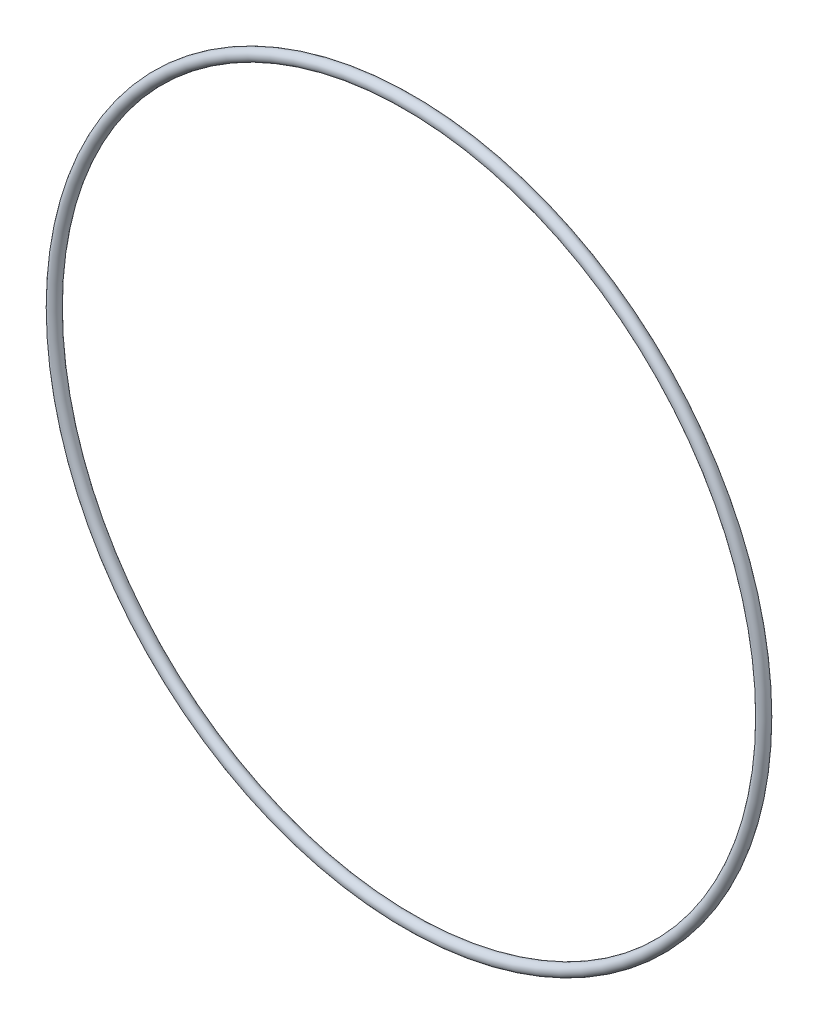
from build123d import *

# Parameters (mm, degrees)
SKETCH1_R = 1.7653


with BuildPart() as part:
    # Sketch1 → Revolve1 (revolve)
    with BuildSketch(Plane(origin=(0, 0, 0), x_dir=(0, -1, 0), z_dir=(1, 0, 0)), mode=Mode.PRIVATE) as revolve1_sk:
        with Locations((109.5121, 0)):
            Circle(SKETCH1_R)
    revolve(revolve1_sk.sketch.rotate(Axis((0, 0, 1.7653), (0, 0, -1)), 270), axis=Axis((0, 0, 1.7653), (0, 0, -1)))


solid = part.part
